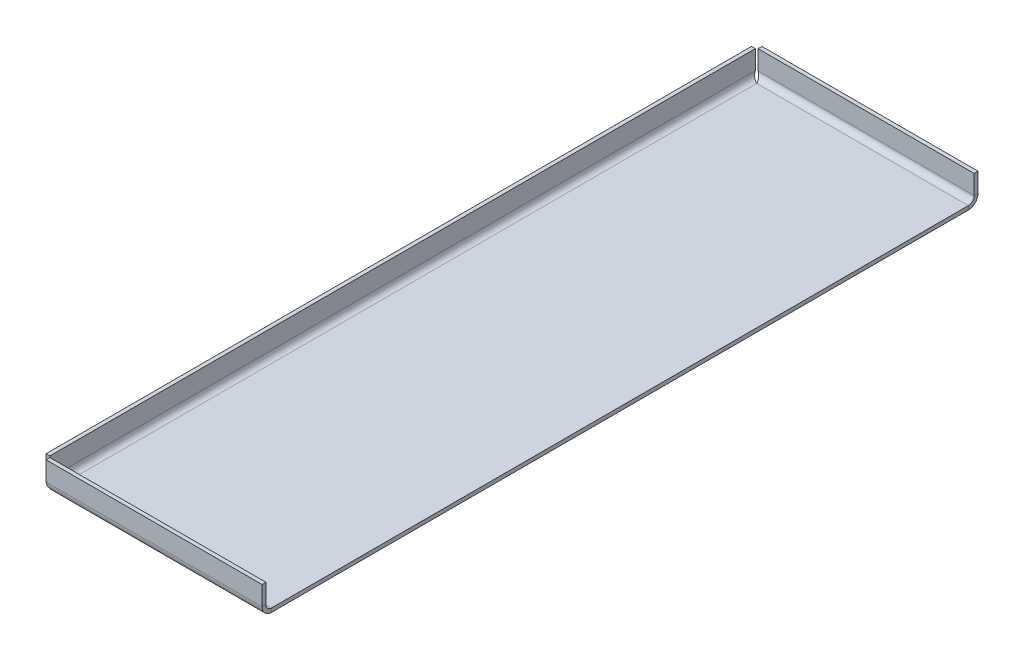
ISO-10303-21;
HEADER;
FILE_DESCRIPTION(('STEP AP214'),'2;1');
FILE_NAME('part.step','',(''),(''),'','','');
FILE_SCHEMA(('AUTOMOTIVE_DESIGN { 1 0 10303 214 1 1 1 1 }'));
ENDSEC;
DATA;
#1=APPLICATION_CONTEXT('core data for automotive mechanical design processes');
#2=APPLICATION_PROTOCOL_DEFINITION('international standard','automotive_design',2000,#1);
#3=PRODUCT_CONTEXT('',#1,'mechanical');
#4=PRODUCT('Part','Part','',(#3));
#5=PRODUCT_RELATED_PRODUCT_CATEGORY('part','',(#4));
#6=PRODUCT_DEFINITION_FORMATION('','',#4);
#7=PRODUCT_DEFINITION_CONTEXT('part definition',#1,'design');
#8=PRODUCT_DEFINITION('design','',#6,#7);
#9=PRODUCT_DEFINITION_SHAPE('','',#8);
#10=(LENGTH_UNIT() NAMED_UNIT(*) SI_UNIT(.MILLI.,.METRE.));
#11=(NAMED_UNIT(*) PLANE_ANGLE_UNIT() SI_UNIT($,.RADIAN.));
#12=(NAMED_UNIT(*) SI_UNIT($,.STERADIAN.) SOLID_ANGLE_UNIT());
#13=UNCERTAINTY_MEASURE_WITH_UNIT(LENGTH_MEASURE(1.E-05),#10,'distance_accuracy_value','');
#14=(GEOMETRIC_REPRESENTATION_CONTEXT(3) GLOBAL_UNCERTAINTY_ASSIGNED_CONTEXT((#13)) GLOBAL_UNIT_ASSIGNED_CONTEXT((#10,
#11,#12)) REPRESENTATION_CONTEXT('',''));
#15=CARTESIAN_POINT('',(0.,0.,0.));
#16=DIRECTION('',(0.,0.,1.));
#17=DIRECTION('',(1.,0.,0.));
#18=AXIS2_PLACEMENT_3D('',#15,#16,#17);
#19=CARTESIAN_POINT('',(-55.,-2.,181.));
#20=DIRECTION('',(0.,1.,0.));
#21=DIRECTION('',(-1.,0.,0.));
#22=AXIS2_PLACEMENT_3D('',#19,#20,#21);
#23=PLANE('',#22);
#24=DIRECTION('',(1.,0.,0.));
#25=VECTOR('',#24,1.);
#26=CARTESIAN_POINT('',(-55.,-2.,-181.));
#27=LINE('',#26,#25);
#28=CARTESIAN_POINT('',(-55.,-1.99999999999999,-181.));
#29=VERTEX_POINT('',#28);
#30=CARTESIAN_POINT('',(55.,-1.99999999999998,-181.));
#31=VERTEX_POINT('',#30);
#32=EDGE_CURVE('E300',#29,#31,#27,.T.);
#33=ORIENTED_EDGE('',*,*,#32,.T.);
#34=DIRECTION('',(0.,0.,-1.));
#35=VECTOR('',#34,1.);
#36=CARTESIAN_POINT('',(55.,-1.99999999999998,181.));
#37=LINE('',#36,#35);
#38=CARTESIAN_POINT('',(55.,-2.,181.));
#39=VERTEX_POINT('',#38);
#40=EDGE_CURVE('E13',#39,#31,#37,.T.);
#41=ORIENTED_EDGE('',*,*,#40,.F.);
#42=DIRECTION('',(1.,0.,0.));
#43=VECTOR('',#42,1.);
#44=CARTESIAN_POINT('',(-55.,-2.,181.));
#45=LINE('',#44,#43);
#46=CARTESIAN_POINT('',(-55.,-2.00000000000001,181.));
#47=VERTEX_POINT('',#46);
#48=EDGE_CURVE('E323',#47,#39,#45,.T.);
#49=ORIENTED_EDGE('',*,*,#48,.F.);
#50=DIRECTION('',(0.,0.,-1.));
#51=VECTOR('',#50,1.);
#52=CARTESIAN_POINT('',(-55.,-2.,181.));
#53=LINE('',#52,#51);
#54=EDGE_CURVE('E303',#47,#29,#53,.T.);
#55=ORIENTED_EDGE('',*,*,#54,.T.);
#56=EDGE_LOOP('',(#33,#41,#49,#55));
#57=FACE_BOUND('',#56,.T.);
#58=ADVANCED_FACE('F95',(#57),#23,.F.);
#59=CARTESIAN_POINT('',(55.,0.,181.));
#60=DIRECTION('',(1.,0.,0.));
#61=DIRECTION('',(0.,0.,-1.));
#62=AXIS2_PLACEMENT_3D('',#59,#60,#61);
#63=PLANE('',#62);
#64=DIRECTION('',(0.,-1.,0.));
#65=VECTOR('',#64,1.);
#66=CARTESIAN_POINT('',(55.,0.,-181.));
#67=LINE('',#66,#65);
#68=CARTESIAN_POINT('',(55.,0.,-181.));
#69=VERTEX_POINT('',#68);
#70=EDGE_CURVE('E306',#69,#31,#67,.T.);
#71=ORIENTED_EDGE('',*,*,#70,.F.);
#72=DIRECTION('',(0.,0.,-1.));
#73=VECTOR('',#72,1.);
#74=CARTESIAN_POINT('',(55.,0.,181.));
#75=LINE('',#74,#73);
#76=CARTESIAN_POINT('',(55.,0.,181.));
#77=VERTEX_POINT('',#76);
#78=EDGE_CURVE('E103',#77,#69,#75,.T.);
#79=ORIENTED_EDGE('',*,*,#78,.F.);
#80=DIRECTION('',(0.,-1.,0.));
#81=VECTOR('',#80,1.);
#82=CARTESIAN_POINT('',(55.,0.,181.));
#83=LINE('',#82,#81);
#84=EDGE_CURVE('E685',#77,#39,#83,.T.);
#85=ORIENTED_EDGE('',*,*,#84,.T.);
#86=ORIENTED_EDGE('',*,*,#40,.T.);
#87=EDGE_LOOP('',(#71,#79,#85,#86));
#88=FACE_BOUND('',#87,.T.);
#89=ADVANCED_FACE('F290',(#88),#63,.T.);
#90=CARTESIAN_POINT('',(-55.,0.,181.));
#91=DIRECTION('',(0.,1.,0.));
#92=DIRECTION('',(-1.,0.,0.));
#93=AXIS2_PLACEMENT_3D('',#90,#91,#92);
#94=PLANE('',#93);
#95=DIRECTION('',(1.,0.,0.));
#96=VECTOR('',#95,1.);
#97=CARTESIAN_POINT('',(-55.,0.,-181.));
#98=LINE('',#97,#96);
#99=CARTESIAN_POINT('',(-55.,0.,-181.));
#100=VERTEX_POINT('',#99);
#101=EDGE_CURVE('E310',#100,#69,#98,.T.);
#102=ORIENTED_EDGE('',*,*,#101,.F.);
#103=DIRECTION('',(0.,0.,-1.));
#104=VECTOR('',#103,1.);
#105=CARTESIAN_POINT('',(-55.,0.,181.));
#106=LINE('',#105,#104);
#107=CARTESIAN_POINT('',(-55.,0.,181.));
#108=VERTEX_POINT('',#107);
#109=EDGE_CURVE('E325',#108,#100,#106,.T.);
#110=ORIENTED_EDGE('',*,*,#109,.F.);
#111=DIRECTION('',(1.,0.,0.));
#112=VECTOR('',#111,1.);
#113=CARTESIAN_POINT('',(-55.,0.,181.));
#114=LINE('',#113,#112);
#115=EDGE_CURVE('E329',#108,#77,#114,.T.);
#116=ORIENTED_EDGE('',*,*,#115,.T.);
#117=ORIENTED_EDGE('',*,*,#78,.T.);
#118=EDGE_LOOP('',(#102,#110,#116,#117));
#119=FACE_BOUND('',#118,.T.);
#120=ADVANCED_FACE('F295',(#119),#94,.T.);
#121=CARTESIAN_POINT('',(55.,3.00000000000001,-181.));
#122=DIRECTION('',(1.,0.,0.));
#123=DIRECTION('',(0.,0.,-1.));
#124=AXIS2_PLACEMENT_3D('',#121,#122,#123);
#125=PLANE('',#124);
#126=DIRECTION('',(0.,0.,1.));
#127=VECTOR('',#126,1.);
#128=CARTESIAN_POINT('',(55.,3.00000000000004,-186.));
#129=LINE('',#128,#127);
#130=CARTESIAN_POINT('',(55.,3.,-184.));
#131=VERTEX_POINT('',#130);
#132=CARTESIAN_POINT('',(55.,2.99999999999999,-186.));
#133=VERTEX_POINT('',#132);
#134=EDGE_CURVE('E337',#131,#133,#129,.F.);
#135=ORIENTED_EDGE('',*,*,#134,.F.);
#136=CARTESIAN_POINT('',(55.,3.00000000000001,-181.));
#137=DIRECTION('',(-1.,0.,0.));
#138=DIRECTION('',(0.,0.,1.));
#139=AXIS2_PLACEMENT_3D('',#136,#137,#138);
#140=CIRCLE('',#139,3.);
#141=EDGE_CURVE('E336',#69,#131,#140,.F.);
#142=ORIENTED_EDGE('',*,*,#141,.F.);
#143=ORIENTED_EDGE('',*,*,#70,.T.);
#144=CARTESIAN_POINT('',(55.,3.00000000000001,-181.));
#145=DIRECTION('',(-1.,0.,0.));
#146=DIRECTION('',(0.,0.,1.));
#147=AXIS2_PLACEMENT_3D('',#144,#145,#146);
#148=CIRCLE('',#147,5.);
#149=EDGE_CURVE('E307',#31,#133,#148,.F.);
#150=ORIENTED_EDGE('',*,*,#149,.T.);
#151=EDGE_LOOP('',(#135,#142,#143,#150));
#152=FACE_BOUND('',#151,.T.);
#153=ADVANCED_FACE('F333',(#152),#125,.T.);
#154=CARTESIAN_POINT('',(-57.2928932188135,3.00000000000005,-186.02));
#155=CARTESIAN_POINT('',(-57.1017870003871,2.34277428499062,-186.02));
#156=CARTESIAN_POINT('',(-56.9107443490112,1.68602562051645,-185.889342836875));
#157=CARTESIAN_POINT('',(-56.528595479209,0.471832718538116,-185.386407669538));
#158=CARTESIAN_POINT('',(-56.3375210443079,-0.0850245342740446,-185.014327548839));
#159=CARTESIAN_POINT('',(-55.9553721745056,-1.01432754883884,-184.085024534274));
#160=CARTESIAN_POINT('',(-55.7642977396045,-1.38640766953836,-183.528167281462));
#161=CARTESIAN_POINT('',(-55.3821488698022,-1.88934283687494,-182.313974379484));
#162=CARTESIAN_POINT('',(-55.1911062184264,-2.01999999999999,-181.65722571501));
#163=CARTESIAN_POINT('',(-55.,-2.01999999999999,-181.));
#164=CARTESIAN_POINT('',(-57.2928932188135,3.00000000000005,-186.));
#165=CARTESIAN_POINT('',(-57.1017870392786,2.34539279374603,-186.));
#166=CARTESIAN_POINT('',(-56.9107443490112,1.69126057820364,-185.869863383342));
#167=CARTESIAN_POINT('',(-56.528595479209,0.481905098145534,-185.368931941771));
#168=CARTESIAN_POINT('',(-56.3375210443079,-0.0727335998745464,-184.998334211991));
#169=CARTESIAN_POINT('',(-55.9553721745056,-0.998334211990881,-184.072733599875));
#170=CARTESIAN_POINT('',(-55.7642977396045,-1.36893194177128,-183.518094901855));
#171=CARTESIAN_POINT('',(-55.3821488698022,-1.86986338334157,-182.308739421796));
#172=CARTESIAN_POINT('',(-55.1911061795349,-1.99999999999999,-181.654607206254));
#173=CARTESIAN_POINT('',(-55.,-1.99999999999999,-181.));
#174=CARTESIAN_POINT('',(-57.2928932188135,3.00000000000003,-184.));
#175=CARTESIAN_POINT('',(-57.1017909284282,2.60724366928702,-184.));
#176=CARTESIAN_POINT('',(-56.9107443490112,2.21475634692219,-183.921918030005));
#177=CARTESIAN_POINT('',(-56.528595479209,1.48914305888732,-183.621359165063));
#178=CARTESIAN_POINT('',(-56.3375210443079,1.15635984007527,-183.399000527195));
#179=CARTESIAN_POINT('',(-55.9553721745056,0.600999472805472,-182.843640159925));
#180=CARTESIAN_POINT('',(-55.7642977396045,0.378640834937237,-182.510856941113));
#181=CARTESIAN_POINT('',(-55.3821488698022,0.0780819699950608,-181.785243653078));
#182=CARTESIAN_POINT('',(-55.1911022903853,0.,-181.392756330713));
#183=CARTESIAN_POINT('',(-55.,0.,-181.));
#184=CARTESIAN_POINT('',(-57.2928932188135,3.00000000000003,-183.9798));
#185=CARTESIAN_POINT('',(-57.1017909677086,2.60988836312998,-183.9798));
#186=CARTESIAN_POINT('',(-56.9107443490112,2.22004365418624,-183.902243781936));
#187=CARTESIAN_POINT('',(-56.528595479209,1.49931616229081,-183.603708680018));
#188=CARTESIAN_POINT('',(-56.3375210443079,1.16877368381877,-183.382847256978));
#189=CARTESIAN_POINT('',(-55.9553721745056,0.617152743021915,-182.831226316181));
#190=CARTESIAN_POINT('',(-55.7642977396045,0.396291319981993,-182.500683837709));
#191=CARTESIAN_POINT('',(-55.3821488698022,0.0977562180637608,-181.779956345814));
#192=CARTESIAN_POINT('',(-55.1911022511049,0.0202000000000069,-181.39011163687));
#193=CARTESIAN_POINT('',(-55.,0.0202000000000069,-181.));
#194=B_SPLINE_SURFACE_WITH_KNOTS('',1,3,((#154,#155,#156,#157,#158,#159,#160,#161,#162,#163),
(#164,#165,#166,#167,#168,#169,#170,#171,#172,#173),(#174,#175,#176,#177,#178,#179,#180,#181,
#182,#183),(#184,#185,#186,#187,#188,#189,#190,#191,#192,#193)),.UNSPECIFIED.,.F.,.F.,.F.,(2,1,
1,2),(4,2,2,2,4),(-0.01,0.,1.,1.0101),(0.,0.25,0.5,0.75,1.),.UNSPECIFIED.);
#195=CARTESIAN_POINT('',(-57.2928932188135,3.00000000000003,-184.));
#196=CARTESIAN_POINT('',(-57.2552663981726,2.92267324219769,-183.999998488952));
#197=CARTESIAN_POINT('',(-57.2176563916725,2.84537873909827,-183.997008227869));
#198=CARTESIAN_POINT('',(-57.1424432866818,2.69126243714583,-183.985073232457));
#199=CARTESIAN_POINT('',(-57.1048401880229,2.61444056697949,-183.976129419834));
#200=CARTESIAN_POINT('',(-56.9919821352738,2.38525678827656,-183.940400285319));
#201=CARTESIAN_POINT('',(-56.9166800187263,2.23418002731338,-183.904717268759));
#202=CARTESIAN_POINT('',(-56.7957539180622,1.99743986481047,-183.829084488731));
#203=CARTESIAN_POINT('',(-56.7500950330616,1.90939953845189,-183.796320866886));
#204=CARTESIAN_POINT('',(-56.658779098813,1.73677909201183,-183.722693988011));
#205=CARTESIAN_POINT('',(-56.6131220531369,1.65219794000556,-183.681833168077));
#206=CARTESIAN_POINT('',(-56.5217962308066,1.48720795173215,-183.592349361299));
#207=CARTESIAN_POINT('',(-56.4761274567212,1.40680079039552,-183.543723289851));
#208=CARTESIAN_POINT('',(-56.3848064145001,1.25092626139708,-183.439168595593));
#209=CARTESIAN_POINT('',(-56.3391541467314,1.17545701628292,-183.38324277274));
#210=CARTESIAN_POINT('',(-56.247827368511,1.03006114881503,-183.264542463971));
#211=CARTESIAN_POINT('',(-56.202152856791,0.960136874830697,-183.201765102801));
#212=CARTESIAN_POINT('',(-56.1108207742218,0.826504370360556,-183.069956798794));
#213=CARTESIAN_POINT('',(-56.0651632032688,0.76279388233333,-183.000928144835));
#214=CARTESIAN_POINT('',(-55.9738172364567,0.642076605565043,-182.857152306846));
#215=CARTESIAN_POINT('',(-55.9281288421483,0.585074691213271,-182.782401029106));
#216=CARTESIAN_POINT('',(-55.836770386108,0.47835042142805,-182.627911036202));
#217=CARTESIAN_POINT('',(-55.791100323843,0.428625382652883,-182.548174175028));
#218=CARTESIAN_POINT('',(-55.6997154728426,0.336827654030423,-182.384319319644));
#219=CARTESIAN_POINT('',(-55.6540006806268,0.294761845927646,-182.30019747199));
#220=CARTESIAN_POINT('',(-55.5625885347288,0.218721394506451,-182.128409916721));
#221=CARTESIAN_POINT('',(-55.5168911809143,0.184743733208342,-182.040745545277));
#222=CARTESIAN_POINT('',(-55.4255435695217,0.125188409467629,-181.862706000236));
#223=CARTESIAN_POINT('',(-55.3798933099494,0.0996024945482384,-181.772333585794));
#224=CARTESIAN_POINT('',(-55.2886128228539,0.0570188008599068,-181.589622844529));
#225=CARTESIAN_POINT('',(-55.2429825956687,0.040017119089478,-181.497285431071));
#226=CARTESIAN_POINT('',(-55.1644349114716,0.0182567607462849,-181.337323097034));
#227=CARTESIAN_POINT('',(-55.1315153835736,0.0114072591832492,-181.269976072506));
#228=CARTESIAN_POINT('',(-55.0657315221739,0.00228142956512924,-181.135087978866));
#229=CARTESIAN_POINT('',(-55.0328671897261,-2.63273380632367E-06,-181.067547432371));
#230=CARTESIAN_POINT('',(-55.,0.,-181.));
#231=B_SPLINE_CURVE_WITH_KNOTS('',3,(#195,#196,#197,#198,#199,#200,#201,#202,#203,#204,#205,
#206,#207,#208,#209,#210,#211,#212,#213,#214,#215,#216,#217,#218,#219,#220,#221,#222,#223,#224,
#225,#226,#227,#228,#229,#230),.UNSPECIFIED.,.F.,.F.,(4,2,2,2,2,2,2,2,2,2,2,2,2,2,2,2,2,4),(0.,
0.257861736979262,0.515683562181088,1.03133815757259,1.34437075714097,1.65730928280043,
1.97037242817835,2.28331584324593,2.59639109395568,2.90935217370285,3.22253926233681,
3.53561057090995,3.84896179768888,4.16219591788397,4.47512107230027,4.78790382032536,
5.01359498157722,5.23890347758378),.UNSPECIFIED.);
#232=CARTESIAN_POINT('',(-57.2928932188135,3.,-184.));
#233=VERTEX_POINT('',#232);
#234=EDGE_CURVE('E340',#233,#100,#231,.T.);
#235=DIRECTION('',(0.,0.,1.));
#236=VECTOR('',#235,1.);
#237=CARTESIAN_POINT('',(-57.2928932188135,3.00000000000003,-184.));
#238=LINE('',#237,#236);
#239=CARTESIAN_POINT('',(-57.2928932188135,3.00000000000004,-186.));
#240=VERTEX_POINT('',#239);
#241=EDGE_CURVE('E734',#233,#240,#238,.F.);
#242=CARTESIAN_POINT('',(-57.2928932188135,3.00000000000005,-186.));
#243=CARTESIAN_POINT('',(-57.2501181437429,2.85348621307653,-186.000017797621));
#244=CARTESIAN_POINT('',(-57.2073439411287,2.70697482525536,-185.99356086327));
#245=CARTESIAN_POINT('',(-57.1217996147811,2.41508918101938,-185.967826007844));
#246=CARTESIAN_POINT('',(-57.0790294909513,2.26971486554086,-185.948548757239));
#247=CARTESIAN_POINT('',(-56.9935246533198,1.98133302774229,-185.897321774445));
#248=CARTESIAN_POINT('',(-56.9507899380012,1.83832374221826,-185.865381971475));
#249=CARTESIAN_POINT('',(-56.8653171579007,1.55566100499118,-185.789082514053));
#250=CARTESIAN_POINT('',(-56.8225790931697,1.41600750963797,-185.744723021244));
#251=CARTESIAN_POINT('',(-56.7370801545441,1.14105532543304,-185.643896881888));
#252=CARTESIAN_POINT('',(-56.694319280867,1.00575904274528,-185.587423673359));
#253=CARTESIAN_POINT('',(-56.6087814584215,0.74059630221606,-185.462797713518));
#254=CARTESIAN_POINT('',(-56.5660045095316,0.610731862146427,-185.394640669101));
#255=CARTESIAN_POINT('',(-56.4804798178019,0.357562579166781,-185.247230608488));
#256=CARTESIAN_POINT('',(-56.4377320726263,0.234253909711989,-185.16798416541));
#257=CARTESIAN_POINT('',(-56.3522195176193,-0.0049751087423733,-184.998947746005));
#258=CARTESIAN_POINT('',(-56.3094547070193,-0.120892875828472,-184.909154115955));
#259=CARTESIAN_POINT('',(-56.2239329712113,-0.344373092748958,-184.719760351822));
#260=CARTESIAN_POINT('',(-56.1811760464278,-0.451937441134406,-184.620162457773));
#261=CARTESIAN_POINT('',(-56.0956618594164,-0.6579105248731,-184.411911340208));
#262=CARTESIAN_POINT('',(-56.0529045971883,-0.756319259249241,-184.303258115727));
#263=CARTESIAN_POINT('',(-55.9673708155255,-0.943270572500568,-184.077675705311));
#264=CARTESIAN_POINT('',(-55.9245942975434,-1.0318080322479,-183.960742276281));
#265=CARTESIAN_POINT('',(-55.839057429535,-1.19824493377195,-183.719594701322));
#266=CARTESIAN_POINT('',(-55.7962970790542,-1.27614806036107,-183.595383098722));
#267=CARTESIAN_POINT('',(-55.7107411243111,-1.42080344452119,-183.340509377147));
#268=CARTESIAN_POINT('',(-55.6679455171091,-1.48754751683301,-183.209842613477));
#269=CARTESIAN_POINT('',(-55.5823707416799,-1.60927791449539,-182.943200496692));
#270=CARTESIAN_POINT('',(-55.5395915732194,-1.66426857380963,-182.807227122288));
#271=CARTESIAN_POINT('',(-55.454064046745,-1.76206307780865,-182.531076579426));
#272=CARTESIAN_POINT('',(-55.4113156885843,-1.80487561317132,-182.39090248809));
#273=CARTESIAN_POINT('',(-55.3258379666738,-1.8780239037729,-182.107388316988));
#274=CARTESIAN_POINT('',(-55.283108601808,-1.90836432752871,-181.964049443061));
#275=CARTESIAN_POINT('',(-55.2002816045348,-1.95487405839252,-181.684164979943));
#276=CARTESIAN_POINT('',(-55.1601839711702,-1.97180107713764,-181.547744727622));
#277=CARTESIAN_POINT('',(-55.0800580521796,-1.99436061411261,-181.274216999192));
#278=CARTESIAN_POINT('',(-55.0400297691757,-2.0000130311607,-181.137111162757));
#279=CARTESIAN_POINT('',(-55.,-1.99999999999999,-181.));
#280=B_SPLINE_CURVE_WITH_KNOTS('',3,(#242,#243,#244,#245,#246,#247,#248,#249,#250,#251,#252,
#253,#254,#255,#256,#257,#258,#259,#260,#261,#262,#263,#264,#265,#266,#267,#268,#269,#270,#271,
#272,#273,#274,#275,#276,#277,#278,#279),.UNSPECIFIED.,.F.,.F.,(4,2,2,2,2,2,2,2,2,2,2,2,2,2,2,2,
2,2,4),(0.,0.457750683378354,0.915477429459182,1.37284596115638,1.83020854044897,
2.2878195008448,2.74559896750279,3.20310823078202,3.6607764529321,4.11834035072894,
4.57590429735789,5.03370443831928,5.49134554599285,5.94932087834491,6.40712704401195,
6.86460568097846,7.32191291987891,7.75105444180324,8.17943788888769),.UNSPECIFIED.);
#281=EDGE_CURVE('E313',#240,#29,#280,.T.);
#282=DIRECTION('',(0.,1.,0.));
#283=VECTOR('',#282,1.);
#284=CARTESIAN_POINT('',(-55.,-2.,-181.));
#285=LINE('',#284,#283);
#286=EDGE_CURVE('E320',#29,#100,#285,.T.);
#287=ORIENTED_EDGE('',*,*,#234,.F.);
#288=ORIENTED_EDGE('',*,*,#241,.T.);
#289=ORIENTED_EDGE('',*,*,#281,.T.);
#290=ORIENTED_EDGE('',*,*,#286,.T.);
#291=EDGE_LOOP('',(#287,#288,#289,#290));
#292=FACE_BOUND('',#291,.T.);
#293=ADVANCED_FACE('F357',(#292),#194,.F.);
#294=CARTESIAN_POINT('',(-57.2928932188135,3.00000000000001,-181.));
#295=DIRECTION('',(-1.,0.,0.));
#296=DIRECTION('',(0.,0.,-1.));
#297=AXIS2_PLACEMENT_3D('',#294,#295,#296);
#298=CYLINDRICAL_SURFACE('',#297,5.);
#299=ORIENTED_EDGE('',*,*,#32,.F.);
#300=ORIENTED_EDGE('',*,*,#281,.F.);
#301=DIRECTION('',(-1.,0.,0.));
#302=VECTOR('',#301,1.);
#303=CARTESIAN_POINT('',(55.,3.00000000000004,-186.));
#304=LINE('',#303,#302);
#305=EDGE_CURVE('E778',#240,#133,#304,.F.);
#306=ORIENTED_EDGE('',*,*,#305,.T.);
#307=ORIENTED_EDGE('',*,*,#149,.F.);
#308=EDGE_LOOP('',(#299,#300,#306,#307));
#309=FACE_BOUND('',#308,.T.);
#310=ADVANCED_FACE('F363',(#309),#298,.T.);
#311=CARTESIAN_POINT('',(-57.2928932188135,3.00000000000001,-181.));
#312=DIRECTION('',(-1.,0.,0.));
#313=DIRECTION('',(0.,0.,-1.));
#314=AXIS2_PLACEMENT_3D('',#311,#312,#313);
#315=CYLINDRICAL_SURFACE('',#314,3.);
#316=ORIENTED_EDGE('',*,*,#101,.T.);
#317=ORIENTED_EDGE('',*,*,#141,.T.);
#318=DIRECTION('',(-1.,0.,0.));
#319=VECTOR('',#318,1.);
#320=CARTESIAN_POINT('',(55.,3.00000000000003,-184.));
#321=LINE('',#320,#319);
#322=EDGE_CURVE('E774',#131,#233,#321,.T.);
#323=ORIENTED_EDGE('',*,*,#322,.T.);
#324=ORIENTED_EDGE('',*,*,#234,.T.);
#325=EDGE_LOOP('',(#316,#317,#323,#324));
#326=FACE_BOUND('',#325,.T.);
#327=ADVANCED_FACE('F367',(#326),#315,.F.);
#328=CARTESIAN_POINT('',(55.,0.,-186.));
#329=DIRECTION('',(-1.,0.,0.));
#330=DIRECTION('',(0.,0.,1.));
#331=AXIS2_PLACEMENT_3D('',#328,#329,#330);
#332=PLANE('',#331);
#333=ORIENTED_EDGE('',*,*,#134,.T.);
#334=DIRECTION('',(0.,-1.,0.));
#335=VECTOR('',#334,1.);
#336=CARTESIAN_POINT('',(55.,0.,-186.));
#337=LINE('',#336,#335);
#338=CARTESIAN_POINT('',(55.,13.,-186.));
#339=VERTEX_POINT('',#338);
#340=EDGE_CURVE('E797',#339,#133,#337,.T.);
#341=ORIENTED_EDGE('',*,*,#340,.F.);
#342=DIRECTION('',(0.,0.,1.));
#343=VECTOR('',#342,1.);
#344=CARTESIAN_POINT('',(55.,13.,-186.));
#345=LINE('',#344,#343);
#346=CARTESIAN_POINT('',(55.,13.,-184.));
#347=VERTEX_POINT('',#346);
#348=EDGE_CURVE('E344',#339,#347,#345,.T.);
#349=ORIENTED_EDGE('',*,*,#348,.T.);
#350=DIRECTION('',(0.,1.,0.));
#351=VECTOR('',#350,1.);
#352=CARTESIAN_POINT('',(55.,0.,-184.));
#353=LINE('',#352,#351);
#354=EDGE_CURVE('E802',#347,#131,#353,.F.);
#355=ORIENTED_EDGE('',*,*,#354,.T.);
#356=EDGE_LOOP('',(#333,#341,#349,#355));
#357=FACE_BOUND('',#356,.T.);
#358=ADVANCED_FACE('F372',(#357),#332,.F.);
#359=CARTESIAN_POINT('',(-55.,0.,-186.));
#360=DIRECTION('',(0.,0.,1.));
#361=DIRECTION('',(0.,-1.,0.));
#362=AXIS2_PLACEMENT_3D('',#359,#360,#361);
#363=PLANE('',#362);
#364=ORIENTED_EDGE('',*,*,#305,.F.);
#365=DIRECTION('',(0.,1.,0.));
#366=VECTOR('',#365,1.);
#367=CARTESIAN_POINT('',(-57.2928932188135,0.,-186.));
#368=LINE('',#367,#366);
#369=CARTESIAN_POINT('',(-57.2928932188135,13.,-186.));
#370=VERTEX_POINT('',#369);
#371=EDGE_CURVE('E782',#240,#370,#368,.T.);
#372=ORIENTED_EDGE('',*,*,#371,.T.);
#373=DIRECTION('',(1.,0.,0.));
#374=VECTOR('',#373,1.);
#375=CARTESIAN_POINT('',(-55.,13.,-186.));
#376=LINE('',#375,#374);
#377=EDGE_CURVE('E801',#370,#339,#376,.T.);
#378=ORIENTED_EDGE('',*,*,#377,.T.);
#379=ORIENTED_EDGE('',*,*,#340,.T.);
#380=EDGE_LOOP('',(#364,#372,#378,#379));
#381=FACE_BOUND('',#380,.T.);
#382=ADVANCED_FACE('F429',(#381),#363,.F.);
#383=CARTESIAN_POINT('',(-55.,0.,-184.));
#384=DIRECTION('',(0.,0.,1.));
#385=DIRECTION('',(0.,-1.,0.));
#386=AXIS2_PLACEMENT_3D('',#383,#384,#385);
#387=PLANE('',#386);
#388=DIRECTION('',(-1.,0.,0.));
#389=VECTOR('',#388,1.);
#390=CARTESIAN_POINT('',(55.,13.,-184.));
#391=LINE('',#390,#389);
#392=CARTESIAN_POINT('',(-57.2928932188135,13.,-184.));
#393=VERTEX_POINT('',#392);
#394=EDGE_CURVE('E780',#393,#347,#391,.F.);
#395=ORIENTED_EDGE('',*,*,#394,.F.);
#396=DIRECTION('',(0.,-1.,0.));
#397=VECTOR('',#396,1.);
#398=CARTESIAN_POINT('',(-57.2928932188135,13.,-184.));
#399=LINE('',#398,#397);
#400=EDGE_CURVE('E791',#233,#393,#399,.F.);
#401=ORIENTED_EDGE('',*,*,#400,.F.);
#402=ORIENTED_EDGE('',*,*,#322,.F.);
#403=ORIENTED_EDGE('',*,*,#354,.F.);
#404=EDGE_LOOP('',(#395,#401,#402,#403));
#405=FACE_BOUND('',#404,.T.);
#406=ADVANCED_FACE('F438',(#405),#387,.T.);
#407=CARTESIAN_POINT('',(55.,13.,-186.));
#408=DIRECTION('',(0.,-1.,0.));
#409=DIRECTION('',(0.,0.,-1.));
#410=AXIS2_PLACEMENT_3D('',#407,#408,#409);
#411=PLANE('',#410);
#412=ORIENTED_EDGE('',*,*,#394,.T.);
#413=ORIENTED_EDGE('',*,*,#348,.F.);
#414=ORIENTED_EDGE('',*,*,#377,.F.);
#415=DIRECTION('',(0.,0.,1.));
#416=VECTOR('',#415,1.);
#417=CARTESIAN_POINT('',(-57.2928932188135,13.,-186.));
#418=LINE('',#417,#416);
#419=EDGE_CURVE('E788',#370,#393,#418,.T.);
#420=ORIENTED_EDGE('',*,*,#419,.T.);
#421=EDGE_LOOP('',(#412,#413,#414,#420));
#422=FACE_BOUND('',#421,.T.);
#423=ADVANCED_FACE('F368',(#422),#411,.F.);
#424=CARTESIAN_POINT('',(-57.2928932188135,13.,-186.));
#425=DIRECTION('',(1.,0.,0.));
#426=DIRECTION('',(0.,0.,-1.));
#427=AXIS2_PLACEMENT_3D('',#424,#425,#426);
#428=PLANE('',#427);
#429=ORIENTED_EDGE('',*,*,#241,.F.);
#430=ORIENTED_EDGE('',*,*,#400,.T.);
#431=ORIENTED_EDGE('',*,*,#419,.F.);
#432=ORIENTED_EDGE('',*,*,#371,.F.);
#433=EDGE_LOOP('',(#429,#430,#431,#432));
#434=FACE_BOUND('',#433,.T.);
#435=ADVANCED_FACE('F457',(#434),#428,.F.);
#436=CARTESIAN_POINT('',(-55.,-2.02000000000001,-181.));
#437=CARTESIAN_POINT('',(-55.6572257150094,-2.02000000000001,-181.191106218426));
#438=CARTESIAN_POINT('',(-56.3139743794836,-1.88934283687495,-181.382148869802));
#439=CARTESIAN_POINT('',(-57.5281672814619,-1.38640766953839,-181.764297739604));
#440=CARTESIAN_POINT('',(-58.0850245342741,-1.01432754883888,-181.955372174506));
#441=CARTESIAN_POINT('',(-59.0143275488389,-0.0850245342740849,-182.337521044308));
#442=CARTESIAN_POINT('',(-59.3864076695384,0.471832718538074,-182.528595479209));
#443=CARTESIAN_POINT('',(-59.889342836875,1.6860256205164,-182.910744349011));
#444=CARTESIAN_POINT('',(-60.02,2.34277428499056,-183.101787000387));
#445=CARTESIAN_POINT('',(-60.02,2.99999999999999,-183.292893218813));
#446=CARTESIAN_POINT('',(-55.,-2.00000000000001,-181.));
#447=CARTESIAN_POINT('',(-55.654607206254,-2.00000000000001,-181.191106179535));
#448=CARTESIAN_POINT('',(-56.3087394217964,-1.86986338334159,-181.382148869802));
#449=CARTESIAN_POINT('',(-57.5180949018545,-1.3689319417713,-181.764297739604));
#450=CARTESIAN_POINT('',(-58.0727335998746,-0.998334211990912,-181.955372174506));
#451=CARTESIAN_POINT('',(-58.9983342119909,-0.0727335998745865,-182.337521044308));
#452=CARTESIAN_POINT('',(-59.3689319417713,0.481905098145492,-182.528595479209));
#453=CARTESIAN_POINT('',(-59.8698633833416,1.69126057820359,-182.910744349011));
#454=CARTESIAN_POINT('',(-60.,2.34539279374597,-183.101787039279));
#455=CARTESIAN_POINT('',(-60.,2.99999999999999,-183.292893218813));
#456=CARTESIAN_POINT('',(-55.,0.,-181.));
#457=CARTESIAN_POINT('',(-55.392756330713,0.,-181.191102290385));
#458=CARTESIAN_POINT('',(-55.7852436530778,0.0780819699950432,-181.382148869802));
#459=CARTESIAN_POINT('',(-56.5108569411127,0.378640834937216,-181.764297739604));
#460=CARTESIAN_POINT('',(-56.8436401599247,0.60099947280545,-181.955372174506));
#461=CARTESIAN_POINT('',(-57.3990005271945,1.15635984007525,-182.337521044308));
#462=CARTESIAN_POINT('',(-57.6213591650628,1.48914305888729,-182.528595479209));
#463=CARTESIAN_POINT('',(-57.921918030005,2.21475634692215,-182.910744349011));
#464=CARTESIAN_POINT('',(-58.,2.60724366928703,-183.101790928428));
#465=CARTESIAN_POINT('',(-58.,2.99999999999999,-183.292893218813));
#466=CARTESIAN_POINT('',(-55.,0.02019999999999,-181.));
#467=CARTESIAN_POINT('',(-55.39011163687,0.0201999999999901,-181.191102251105));
#468=CARTESIAN_POINT('',(-55.7799563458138,0.0977562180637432,-181.382148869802));
#469=CARTESIAN_POINT('',(-56.5006838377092,0.396291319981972,-181.764297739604));
#470=CARTESIAN_POINT('',(-56.8312263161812,0.617152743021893,-181.955372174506));
#471=CARTESIAN_POINT('',(-57.3828472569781,1.16877368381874,-182.337521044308));
#472=CARTESIAN_POINT('',(-57.603708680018,1.49931616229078,-182.528595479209));
#473=CARTESIAN_POINT('',(-57.9022437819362,2.22004365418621,-182.910744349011));
#474=CARTESIAN_POINT('',(-57.9798,2.60988836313,-183.101790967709));
#475=CARTESIAN_POINT('',(-57.9798,2.99999999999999,-183.292893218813));
#476=B_SPLINE_SURFACE_WITH_KNOTS('',1,3,((#436,#437,#438,#439,#440,#441,#442,#443,#444,#445),
(#446,#447,#448,#449,#450,#451,#452,#453,#454,#455),(#456,#457,#458,#459,#460,#461,#462,#463,
#464,#465),(#466,#467,#468,#469,#470,#471,#472,#473,#474,#475)),.UNSPECIFIED.,.F.,.F.,.F.,(2,1,
1,2),(4,2,2,2,4),(-0.01,0.,1.,1.0101),(0.,0.25,0.5,0.75,1.),.UNSPECIFIED.);
#477=DIRECTION('',(1.,0.,0.));
#478=VECTOR('',#477,1.);
#479=CARTESIAN_POINT('',(-60.,2.99999999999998,-183.292893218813));
#480=LINE('',#479,#478);
#481=CARTESIAN_POINT('',(-58.,2.99999999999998,-183.292893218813));
#482=VERTEX_POINT('',#481);
#483=CARTESIAN_POINT('',(-60.,2.99999999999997,-183.292893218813));
#484=VERTEX_POINT('',#483);
#485=EDGE_CURVE('E261',#482,#484,#480,.F.);
#486=CARTESIAN_POINT('',(-55.,0.,-181.));
#487=CARTESIAN_POINT('',(-55.0773267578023,1.51104760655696E-06,-181.037626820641));
#488=CARTESIAN_POINT('',(-55.1546212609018,0.00299177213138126,-181.075236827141));
#489=CARTESIAN_POINT('',(-55.3087375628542,0.0149267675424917,-181.150449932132));
#490=CARTESIAN_POINT('',(-55.3855594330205,0.0238705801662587,-181.18805303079));
#491=CARTESIAN_POINT('',(-55.6147432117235,0.0595997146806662,-181.30091108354));
#492=CARTESIAN_POINT('',(-55.7658199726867,0.095282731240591,-181.376213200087));
#493=CARTESIAN_POINT('',(-56.0025601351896,0.170915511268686,-181.497139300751));
#494=CARTESIAN_POINT('',(-56.0906004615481,0.203679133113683,-181.542798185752));
#495=CARTESIAN_POINT('',(-56.2632209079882,0.277306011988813,-181.63411412));
#496=CARTESIAN_POINT('',(-56.3478020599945,0.318166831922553,-181.679771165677));
#497=CARTESIAN_POINT('',(-56.5127920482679,0.407650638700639,-181.771096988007));
#498=CARTESIAN_POINT('',(-56.5931992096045,0.456276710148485,-181.816765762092));
#499=CARTESIAN_POINT('',(-56.7490737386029,0.560831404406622,-181.908086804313));
#500=CARTESIAN_POINT('',(-56.8245429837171,0.616757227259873,-181.953739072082));
#501=CARTESIAN_POINT('',(-56.969938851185,0.735457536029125,-182.045065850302));
#502=CARTESIAN_POINT('',(-57.0398631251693,0.798234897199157,-182.090740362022));
#503=CARTESIAN_POINT('',(-57.1734956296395,0.930043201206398,-182.182072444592));
#504=CARTESIAN_POINT('',(-57.2372061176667,0.999071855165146,-182.227730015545));
#505=CARTESIAN_POINT('',(-57.357923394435,1.14284769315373,-182.319075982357));
#506=CARTESIAN_POINT('',(-57.4149253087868,1.21759897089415,-182.364764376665));
#507=CARTESIAN_POINT('',(-57.521649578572,1.37208896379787,-182.456122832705));
#508=CARTESIAN_POINT('',(-57.5713746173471,1.45182582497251,-182.50179289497));
#509=CARTESIAN_POINT('',(-57.6631723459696,1.61568068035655,-182.593177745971));
#510=CARTESIAN_POINT('',(-57.7052381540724,1.69980252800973,-182.638892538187));
#511=CARTESIAN_POINT('',(-57.7812786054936,1.8715900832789,-182.730304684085));
#512=CARTESIAN_POINT('',(-57.8152562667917,1.95925445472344,-182.776002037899));
#513=CARTESIAN_POINT('',(-57.8748115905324,2.13729399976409,-182.867349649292));
#514=CARTESIAN_POINT('',(-57.9003975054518,2.22766641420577,-182.912999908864));
#515=CARTESIAN_POINT('',(-57.9429811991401,2.41037715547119,-183.00428039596));
#516=CARTESIAN_POINT('',(-57.9599828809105,2.5027145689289,-183.049910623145));
#517=CARTESIAN_POINT('',(-57.9817432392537,2.66267690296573,-183.128458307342));
#518=CARTESIAN_POINT('',(-57.9885927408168,2.73002392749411,-183.16137783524));
#519=CARTESIAN_POINT('',(-57.9977185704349,2.8649120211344,-183.22716169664));
#520=CARTESIAN_POINT('',(-58.0000026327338,2.93245256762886,-183.260026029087));
#521=CARTESIAN_POINT('',(-58.,2.99999999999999,-183.292893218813));
#522=B_SPLINE_CURVE_WITH_KNOTS('',3,(#486,#487,#488,#489,#490,#491,#492,#493,#494,#495,#496,
#497,#498,#499,#500,#501,#502,#503,#504,#505,#506,#507,#508,#509,#510,#511,#512,#513,#514,#515,
#516,#517,#518,#519,#520,#521),.UNSPECIFIED.,.F.,.F.,(4,2,2,2,2,2,2,2,2,2,2,2,2,2,2,2,2,4),(0.,
0.257861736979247,0.515683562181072,1.03133815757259,1.34437075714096,1.6573092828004,
1.97037242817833,2.28331584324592,2.59639109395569,2.90935217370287,3.22253926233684,
3.53561057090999,3.8489617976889,4.16219591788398,4.4751210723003,4.78790382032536,
5.01359498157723,5.23890347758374),.UNSPECIFIED.);
#523=EDGE_CURVE('E698',#100,#482,#522,.T.);
#524=CARTESIAN_POINT('',(-55.,-2.00000000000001,-181.));
#525=CARTESIAN_POINT('',(-55.1465137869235,-2.00001779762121,-181.042775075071));
#526=CARTESIAN_POINT('',(-55.2930251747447,-1.99356086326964,-181.085549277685));
#527=CARTESIAN_POINT('',(-55.5849108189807,-1.96782600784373,-181.171093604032));
#528=CARTESIAN_POINT('',(-55.7302851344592,-1.94854875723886,-181.213863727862));
#529=CARTESIAN_POINT('',(-56.0186669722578,-1.89732177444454,-181.299368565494));
#530=CARTESIAN_POINT('',(-56.1616762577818,-1.86538197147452,-181.342103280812));
#531=CARTESIAN_POINT('',(-56.4443389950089,-1.78908251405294,-181.427576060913));
#532=CARTESIAN_POINT('',(-56.5839924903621,-1.74472302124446,-181.470314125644));
#533=CARTESIAN_POINT('',(-56.858944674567,-1.64389688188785,-181.555813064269));
#534=CARTESIAN_POINT('',(-56.9942409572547,-1.58742367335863,-181.598573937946));
#535=CARTESIAN_POINT('',(-57.259403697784,-1.46279771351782,-181.684111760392));
#536=CARTESIAN_POINT('',(-57.3892681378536,-1.39464066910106,-181.726888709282));
#537=CARTESIAN_POINT('',(-57.6424374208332,-1.24723060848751,-181.812413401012));
#538=CARTESIAN_POINT('',(-57.765746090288,-1.16798416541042,-181.855161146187));
#539=CARTESIAN_POINT('',(-58.0049751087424,-0.998947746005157,-181.940673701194));
#540=CARTESIAN_POINT('',(-58.1208928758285,-0.909154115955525,-181.983438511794));
#541=CARTESIAN_POINT('',(-58.344373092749,-0.71976035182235,-182.068960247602));
#542=CARTESIAN_POINT('',(-58.4519374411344,-0.620162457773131,-182.111717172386));
#543=CARTESIAN_POINT('',(-58.6579105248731,-0.411911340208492,-182.197231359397));
#544=CARTESIAN_POINT('',(-58.7563192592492,-0.303258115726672,-182.239988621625));
#545=CARTESIAN_POINT('',(-58.9432705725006,-0.0776757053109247,-182.325522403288));
#546=CARTESIAN_POINT('',(-59.0318080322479,0.0392577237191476,-182.36829892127));
#547=CARTESIAN_POINT('',(-59.198244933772,0.280405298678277,-182.453835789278));
#548=CARTESIAN_POINT('',(-59.2761480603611,0.40461690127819,-182.496596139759));
#549=CARTESIAN_POINT('',(-59.4208034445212,0.659490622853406,-182.582152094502));
#550=CARTESIAN_POINT('',(-59.487547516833,0.7901573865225,-182.624947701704));
#551=CARTESIAN_POINT('',(-59.6092779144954,1.05679950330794,-182.710522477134));
#552=CARTESIAN_POINT('',(-59.6642685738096,1.19277287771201,-182.753301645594));
#553=CARTESIAN_POINT('',(-59.7620630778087,1.46892342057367,-182.838829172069));
#554=CARTESIAN_POINT('',(-59.8048756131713,1.60909751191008,-182.881577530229));
#555=CARTESIAN_POINT('',(-59.8780239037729,1.89261168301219,-182.96705525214));
#556=CARTESIAN_POINT('',(-59.9083643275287,2.0359505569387,-183.009784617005));
#557=CARTESIAN_POINT('',(-59.9548740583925,2.31583502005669,-183.092611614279));
#558=CARTESIAN_POINT('',(-59.9718010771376,2.45225527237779,-183.132709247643));
#559=CARTESIAN_POINT('',(-59.9943606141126,2.72578300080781,-183.212835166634));
#560=CARTESIAN_POINT('',(-60.0000130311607,2.86288883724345,-183.252863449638));
#561=CARTESIAN_POINT('',(-60.,2.99999999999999,-183.292893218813));
#562=B_SPLINE_CURVE_WITH_KNOTS('',3,(#524,#525,#526,#527,#528,#529,#530,#531,#532,#533,#534,
#535,#536,#537,#538,#539,#540,#541,#542,#543,#544,#545,#546,#547,#548,#549,#550,#551,#552,#553,
#554,#555,#556,#557,#558,#559,#560,#561),.UNSPECIFIED.,.F.,.F.,(4,2,2,2,2,2,2,2,2,2,2,2,2,2,2,2,
2,2,4),(0.,0.45775068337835,0.915477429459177,1.37284596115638,1.83020854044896,
2.28781950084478,2.74559896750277,3.20310823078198,3.66077645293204,4.11834035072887,
4.5759042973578,5.03370443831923,5.49134554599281,5.94932087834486,6.40712704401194,
6.86460568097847,7.32191291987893,7.75105444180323,8.17943788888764),.UNSPECIFIED.);
#563=EDGE_CURVE('E728',#29,#484,#562,.T.);
#564=ORIENTED_EDGE('',*,*,#485,.F.);
#565=ORIENTED_EDGE('',*,*,#523,.F.);
#566=ORIENTED_EDGE('',*,*,#286,.F.);
#567=ORIENTED_EDGE('',*,*,#563,.T.);
#568=EDGE_LOOP('',(#564,#565,#566,#567));
#569=FACE_BOUND('',#568,.T.);
#570=ADVANCED_FACE('F466',(#569),#476,.F.);
#571=CARTESIAN_POINT('',(-60.02,2.99999999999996,183.292893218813));
#572=CARTESIAN_POINT('',(-60.02,2.34277428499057,183.101787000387));
#573=CARTESIAN_POINT('',(-59.8893428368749,1.68602562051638,182.910744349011));
#574=CARTESIAN_POINT('',(-59.3864076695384,0.471832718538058,182.528595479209));
#575=CARTESIAN_POINT('',(-59.0143275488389,-0.0850245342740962,182.337521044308));
#576=CARTESIAN_POINT('',(-58.0850245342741,-1.01432754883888,181.955372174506));
#577=CARTESIAN_POINT('',(-57.5281672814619,-1.38640766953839,181.764297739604));
#578=CARTESIAN_POINT('',(-56.3139743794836,-1.88934283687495,181.382148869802));
#579=CARTESIAN_POINT('',(-55.6572257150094,-2.02000000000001,181.191106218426));
#580=CARTESIAN_POINT('',(-55.,-2.02000000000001,181.));
#581=CARTESIAN_POINT('',(-60.,2.99999999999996,183.292893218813));
#582=CARTESIAN_POINT('',(-60.,2.34539279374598,183.101787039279));
#583=CARTESIAN_POINT('',(-59.8698633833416,1.69126057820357,182.910744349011));
#584=CARTESIAN_POINT('',(-59.3689319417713,0.481905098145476,182.528595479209));
#585=CARTESIAN_POINT('',(-58.9983342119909,-0.0727335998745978,182.337521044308));
#586=CARTESIAN_POINT('',(-58.0727335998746,-0.998334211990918,181.955372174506));
#587=CARTESIAN_POINT('',(-57.5180949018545,-1.3689319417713,181.764297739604));
#588=CARTESIAN_POINT('',(-56.3087394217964,-1.86986338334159,181.382148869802));
#589=CARTESIAN_POINT('',(-55.654607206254,-2.00000000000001,181.191106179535));
#590=CARTESIAN_POINT('',(-55.,-2.00000000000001,181.));
#591=CARTESIAN_POINT('',(-58.,2.99999999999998,183.292893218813));
#592=CARTESIAN_POINT('',(-58.,2.60724366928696,183.101790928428));
#593=CARTESIAN_POINT('',(-57.9219180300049,2.21475634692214,182.910744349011));
#594=CARTESIAN_POINT('',(-57.6213591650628,1.48914305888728,182.528595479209));
#595=CARTESIAN_POINT('',(-57.3990005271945,1.15635984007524,182.337521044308));
#596=CARTESIAN_POINT('',(-56.8436401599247,0.600999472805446,181.955372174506));
#597=CARTESIAN_POINT('',(-56.5108569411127,0.378640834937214,181.764297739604));
#598=CARTESIAN_POINT('',(-55.7852436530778,0.0780819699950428,181.382148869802));
#599=CARTESIAN_POINT('',(-55.3927563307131,0.,181.191102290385));
#600=CARTESIAN_POINT('',(-55.,0.,181.));
#601=CARTESIAN_POINT('',(-57.9798,2.99999999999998,183.292893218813));
#602=CARTESIAN_POINT('',(-57.9798,2.60988836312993,183.101790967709));
#603=CARTESIAN_POINT('',(-57.9022437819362,2.22004365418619,182.910744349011));
#604=CARTESIAN_POINT('',(-57.603708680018,1.49931616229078,182.528595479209));
#605=CARTESIAN_POINT('',(-57.3828472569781,1.16877368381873,182.337521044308));
#606=CARTESIAN_POINT('',(-56.8312263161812,0.617152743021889,181.955372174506));
#607=CARTESIAN_POINT('',(-56.5006838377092,0.39629131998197,181.764297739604));
#608=CARTESIAN_POINT('',(-55.7799563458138,0.0977562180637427,181.382148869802));
#609=CARTESIAN_POINT('',(-55.3901116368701,0.0201999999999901,181.191102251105));
#610=CARTESIAN_POINT('',(-55.,0.02019999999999,181.));
#611=B_SPLINE_SURFACE_WITH_KNOTS('',1,3,((#571,#572,#573,#574,#575,#576,#577,#578,#579,#580),
(#581,#582,#583,#584,#585,#586,#587,#588,#589,#590),(#591,#592,#593,#594,#595,#596,#597,#598,
#599,#600),(#601,#602,#603,#604,#605,#606,#607,#608,#609,#610)),.UNSPECIFIED.,.F.,.F.,.F.,(2,1,
1,2),(4,2,2,2,4),(-0.01,0.,1.,1.0101),(0.,0.25,0.5,0.75,1.),.UNSPECIFIED.);
#612=CARTESIAN_POINT('',(-58.,2.99999999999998,183.292893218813));
#613=CARTESIAN_POINT('',(-57.9999984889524,2.92267324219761,183.255266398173));
#614=CARTESIAN_POINT('',(-57.9970082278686,2.8453787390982,183.217656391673));
#615=CARTESIAN_POINT('',(-57.9850732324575,2.69126243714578,183.142443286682));
#616=CARTESIAN_POINT('',(-57.9761294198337,2.61444056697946,183.104840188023));
#617=CARTESIAN_POINT('',(-57.9404002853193,2.38525678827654,182.991982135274));
#618=CARTESIAN_POINT('',(-57.9047172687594,2.23418002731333,182.916680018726));
#619=CARTESIAN_POINT('',(-57.8290844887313,1.99743986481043,182.795753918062));
#620=CARTESIAN_POINT('',(-57.7963208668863,1.90939953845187,182.750095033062));
#621=CARTESIAN_POINT('',(-57.7226939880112,1.73677909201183,182.658779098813));
#622=CARTESIAN_POINT('',(-57.6818331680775,1.65219794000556,182.613122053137));
#623=CARTESIAN_POINT('',(-57.5923493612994,1.48720795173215,182.521796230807));
#624=CARTESIAN_POINT('',(-57.5437232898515,1.40680079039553,182.476127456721));
#625=CARTESIAN_POINT('',(-57.4391685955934,1.25092626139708,182.3848064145));
#626=CARTESIAN_POINT('',(-57.3832427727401,1.1754570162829,182.339154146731));
#627=CARTESIAN_POINT('',(-57.2645424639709,1.03006114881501,182.247827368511));
#628=CARTESIAN_POINT('',(-57.2017651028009,0.960136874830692,182.202152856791));
#629=CARTESIAN_POINT('',(-57.0699567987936,0.826504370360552,182.110820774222));
#630=CARTESIAN_POINT('',(-57.0009281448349,0.762793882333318,182.065163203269));
#631=CARTESIAN_POINT('',(-56.8571523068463,0.642076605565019,181.973817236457));
#632=CARTESIAN_POINT('',(-56.7824010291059,0.585074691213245,181.928128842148));
#633=CARTESIAN_POINT('',(-56.6279110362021,0.478350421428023,181.836770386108));
#634=CARTESIAN_POINT('',(-56.5481741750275,0.428625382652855,181.791100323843));
#635=CARTESIAN_POINT('',(-56.3843193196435,0.336827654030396,181.699715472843));
#636=CARTESIAN_POINT('',(-56.3001974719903,0.294761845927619,181.654000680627));
#637=CARTESIAN_POINT('',(-56.1284099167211,0.218721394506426,181.562588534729));
#638=CARTESIAN_POINT('',(-56.0407455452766,0.184743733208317,181.516891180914));
#639=CARTESIAN_POINT('',(-55.8627060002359,0.125188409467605,181.425543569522));
#640=CARTESIAN_POINT('',(-55.7723335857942,0.0996024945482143,181.379893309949));
#641=CARTESIAN_POINT('',(-55.5896228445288,0.0570188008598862,181.288612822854));
#642=CARTESIAN_POINT('',(-55.4972854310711,0.0400171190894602,181.242982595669));
#643=CARTESIAN_POINT('',(-55.3373230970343,0.0182567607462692,181.164434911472));
#644=CARTESIAN_POINT('',(-55.2699760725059,0.0114072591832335,181.131515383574));
#645=CARTESIAN_POINT('',(-55.1350879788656,0.0022814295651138,181.065731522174));
#646=CARTESIAN_POINT('',(-55.0675474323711,-2.63273382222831E-06,181.032867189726));
#647=CARTESIAN_POINT('',(-55.,0.,181.));
#648=B_SPLINE_CURVE_WITH_KNOTS('',3,(#612,#613,#614,#615,#616,#617,#618,#619,#620,#621,#622,
#623,#624,#625,#626,#627,#628,#629,#630,#631,#632,#633,#634,#635,#636,#637,#638,#639,#640,#641,
#642,#643,#644,#645,#646,#647),.UNSPECIFIED.,.F.,.F.,(4,2,2,2,2,2,2,2,2,2,2,2,2,2,2,2,2,4),(0.,
0.257861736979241,0.515683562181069,1.03133815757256,1.34437075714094,1.65730928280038,
1.97037242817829,2.28331584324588,2.59639109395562,2.90935217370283,3.2225392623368,
3.53561057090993,3.84896179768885,4.16219591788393,4.47512107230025,4.78790382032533,
5.0135949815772,5.23890347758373),.UNSPECIFIED.);
#649=CARTESIAN_POINT('',(-58.,2.99999999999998,183.292893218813));
#650=VERTEX_POINT('',#649);
#651=EDGE_CURVE('E691',#650,#108,#648,.T.);
#652=DIRECTION('',(1.,0.,0.));
#653=VECTOR('',#652,1.);
#654=CARTESIAN_POINT('',(-58.,2.99999999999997,183.292893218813));
#655=LINE('',#654,#653);
#656=CARTESIAN_POINT('',(-60.,2.99999999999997,183.292893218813));
#657=VERTEX_POINT('',#656);
#658=EDGE_CURVE('E749',#650,#657,#655,.F.);
#659=CARTESIAN_POINT('',(-60.,2.99999999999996,183.292893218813));
#660=CARTESIAN_POINT('',(-60.0000177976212,2.85348621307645,183.250118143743));
#661=CARTESIAN_POINT('',(-59.9935608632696,2.70697482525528,183.207343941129));
#662=CARTESIAN_POINT('',(-59.9678260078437,2.4150891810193,183.121799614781));
#663=CARTESIAN_POINT('',(-59.9485487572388,2.26971486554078,183.079029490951));
#664=CARTESIAN_POINT('',(-59.8973217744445,1.98133302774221,182.99352465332));
#665=CARTESIAN_POINT('',(-59.8653819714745,1.83832374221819,182.950789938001));
#666=CARTESIAN_POINT('',(-59.7890825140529,1.5556610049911,182.865317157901));
#667=CARTESIAN_POINT('',(-59.7447230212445,1.41600750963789,182.82257909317));
#668=CARTESIAN_POINT('',(-59.6438968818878,1.14105532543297,182.737080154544));
#669=CARTESIAN_POINT('',(-59.5874236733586,1.00575904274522,182.694319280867));
#670=CARTESIAN_POINT('',(-59.4627977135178,0.740596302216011,182.608781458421));
#671=CARTESIAN_POINT('',(-59.394640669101,0.610731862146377,182.566004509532));
#672=CARTESIAN_POINT('',(-59.2472306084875,0.35756257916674,182.480479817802));
#673=CARTESIAN_POINT('',(-59.1679841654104,0.234253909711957,182.437732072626));
#674=CARTESIAN_POINT('',(-58.9989477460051,-0.00497510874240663,182.352219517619));
#675=CARTESIAN_POINT('',(-58.9091541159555,-0.120892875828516,182.309454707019));
#676=CARTESIAN_POINT('',(-58.7197603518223,-0.344373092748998,182.223932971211));
#677=CARTESIAN_POINT('',(-58.6201624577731,-0.451937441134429,182.181176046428));
#678=CARTESIAN_POINT('',(-58.4119113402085,-0.657910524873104,182.095661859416));
#679=CARTESIAN_POINT('',(-58.3032581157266,-0.756319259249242,182.052904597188));
#680=CARTESIAN_POINT('',(-58.0776757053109,-0.943270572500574,181.967370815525));
#681=CARTESIAN_POINT('',(-57.9607422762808,-1.03180803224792,181.924594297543));
#682=CARTESIAN_POINT('',(-57.7195947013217,-1.19824493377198,181.839057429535));
#683=CARTESIAN_POINT('',(-57.5953830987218,-1.27614806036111,181.796297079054));
#684=CARTESIAN_POINT('',(-57.3405093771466,-1.42080344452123,181.710741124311));
#685=CARTESIAN_POINT('',(-57.2098426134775,-1.48754751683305,181.667945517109));
#686=CARTESIAN_POINT('',(-56.943200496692,-1.60927791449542,181.58237074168));
#687=CARTESIAN_POINT('',(-56.8072271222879,-1.66426857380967,181.539591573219));
#688=CARTESIAN_POINT('',(-56.5310765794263,-1.76206307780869,181.454064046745));
#689=CARTESIAN_POINT('',(-56.3909024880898,-1.80487561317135,181.411315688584));
#690=CARTESIAN_POINT('',(-56.1073883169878,-1.87802390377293,181.325837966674));
#691=CARTESIAN_POINT('',(-55.9640494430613,-1.90836432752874,181.283108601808));
#692=CARTESIAN_POINT('',(-55.6841649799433,-1.95487405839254,181.200281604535));
#693=CARTESIAN_POINT('',(-55.5477447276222,-1.97180107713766,181.16018397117));
#694=CARTESIAN_POINT('',(-55.2742169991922,-1.99436061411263,181.08005805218));
#695=CARTESIAN_POINT('',(-55.1371111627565,-2.00001303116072,181.040029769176));
#696=CARTESIAN_POINT('',(-55.,-2.00000000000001,181.));
#697=B_SPLINE_CURVE_WITH_KNOTS('',3,(#659,#660,#661,#662,#663,#664,#665,#666,#667,#668,#669,
#670,#671,#672,#673,#674,#675,#676,#677,#678,#679,#680,#681,#682,#683,#684,#685,#686,#687,#688,
#689,#690,#691,#692,#693,#694,#695,#696),.UNSPECIFIED.,.F.,.F.,(4,2,2,2,2,2,2,2,2,2,2,2,2,2,2,2,
2,2,4),(0.,0.457750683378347,0.915477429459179,1.37284596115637,1.83020854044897,
2.28781950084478,2.74559896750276,3.20310823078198,3.66077645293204,4.11834035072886,
4.5759042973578,5.03370443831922,5.49134554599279,5.94932087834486,6.40712704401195,
6.86460568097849,7.32191291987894,7.75105444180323,8.17943788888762),.UNSPECIFIED.);
#698=EDGE_CURVE('E693',#657,#47,#697,.T.);
#699=DIRECTION('',(0.,1.,0.));
#700=VECTOR('',#699,1.);
#701=CARTESIAN_POINT('',(-55.,-2.,181.));
#702=LINE('',#701,#700);
#703=EDGE_CURVE('E316',#47,#108,#702,.T.);
#704=ORIENTED_EDGE('',*,*,#651,.F.);
#705=ORIENTED_EDGE('',*,*,#658,.T.);
#706=ORIENTED_EDGE('',*,*,#698,.T.);
#707=ORIENTED_EDGE('',*,*,#703,.T.);
#708=EDGE_LOOP('',(#704,#705,#706,#707));
#709=FACE_BOUND('',#708,.T.);
#710=ADVANCED_FACE('F476',(#709),#611,.F.);
#711=CARTESIAN_POINT('',(-55.,2.99999999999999,183.292893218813));
#712=DIRECTION('',(0.,0.,1.));
#713=DIRECTION('',(-1.,0.,0.));
#714=AXIS2_PLACEMENT_3D('',#711,#712,#713);
#715=CYLINDRICAL_SURFACE('',#714,5.);
#716=ORIENTED_EDGE('',*,*,#54,.F.);
#717=ORIENTED_EDGE('',*,*,#698,.F.);
#718=DIRECTION('',(0.,0.,1.));
#719=VECTOR('',#718,1.);
#720=CARTESIAN_POINT('',(-60.,2.99999999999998,-181.));
#721=LINE('',#720,#719);
#722=EDGE_CURVE('E761',#657,#484,#721,.F.);
#723=ORIENTED_EDGE('',*,*,#722,.T.);
#724=ORIENTED_EDGE('',*,*,#563,.F.);
#725=EDGE_LOOP('',(#716,#717,#723,#724));
#726=FACE_BOUND('',#725,.T.);
#727=ADVANCED_FACE('F479',(#726),#715,.T.);
#728=CARTESIAN_POINT('',(-55.,2.99999999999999,183.292893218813));
#729=DIRECTION('',(0.,0.,1.));
#730=DIRECTION('',(-1.,0.,0.));
#731=AXIS2_PLACEMENT_3D('',#728,#729,#730);
#732=CYLINDRICAL_SURFACE('',#731,3.);
#733=ORIENTED_EDGE('',*,*,#109,.T.);
#734=ORIENTED_EDGE('',*,*,#523,.T.);
#735=DIRECTION('',(0.,0.,1.));
#736=VECTOR('',#735,1.);
#737=CARTESIAN_POINT('',(-58.,2.99999999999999,-181.));
#738=LINE('',#737,#736);
#739=EDGE_CURVE('E697',#482,#650,#738,.T.);
#740=ORIENTED_EDGE('',*,*,#739,.T.);
#741=ORIENTED_EDGE('',*,*,#651,.T.);
#742=EDGE_LOOP('',(#733,#734,#740,#741));
#743=FACE_BOUND('',#742,.T.);
#744=ADVANCED_FACE('F489',(#743),#732,.F.);
#745=CARTESIAN_POINT('',(-60.,0.,181.));
#746=DIRECTION('',(1.,0.,0.));
#747=DIRECTION('',(0.,1.,0.));
#748=AXIS2_PLACEMENT_3D('',#745,#746,#747);
#749=PLANE('',#748);
#750=ORIENTED_EDGE('',*,*,#722,.F.);
#751=DIRECTION('',(0.,1.,0.));
#752=VECTOR('',#751,1.);
#753=CARTESIAN_POINT('',(-60.,0.,183.292893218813));
#754=LINE('',#753,#752);
#755=CARTESIAN_POINT('',(-60.,13.,183.292893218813));
#756=VERTEX_POINT('',#755);
#757=EDGE_CURVE('E757',#657,#756,#754,.T.);
#758=ORIENTED_EDGE('',*,*,#757,.T.);
#759=DIRECTION('',(0.,0.,-1.));
#760=VECTOR('',#759,1.);
#761=CARTESIAN_POINT('',(-60.,13.,181.));
#762=LINE('',#761,#760);
#763=CARTESIAN_POINT('',(-60.,13.,-183.292893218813));
#764=VERTEX_POINT('',#763);
#765=EDGE_CURVE('E699',#756,#764,#762,.T.);
#766=ORIENTED_EDGE('',*,*,#765,.T.);
#767=DIRECTION('',(0.,-1.,0.));
#768=VECTOR('',#767,1.);
#769=CARTESIAN_POINT('',(-60.,0.,-183.292893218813));
#770=LINE('',#769,#768);
#771=EDGE_CURVE('E740',#764,#484,#770,.T.);
#772=ORIENTED_EDGE('',*,*,#771,.T.);
#773=EDGE_LOOP('',(#750,#758,#766,#772));
#774=FACE_BOUND('',#773,.T.);
#775=ADVANCED_FACE('F506',(#774),#749,.F.);
#776=CARTESIAN_POINT('',(-58.,0.,181.));
#777=DIRECTION('',(1.,0.,0.));
#778=DIRECTION('',(0.,1.,0.));
#779=AXIS2_PLACEMENT_3D('',#776,#777,#778);
#780=PLANE('',#779);
#781=DIRECTION('',(0.,0.,1.));
#782=VECTOR('',#781,1.);
#783=CARTESIAN_POINT('',(-58.,13.,-181.));
#784=LINE('',#783,#782);
#785=CARTESIAN_POINT('',(-58.,13.,183.292893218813));
#786=VERTEX_POINT('',#785);
#787=CARTESIAN_POINT('',(-58.,13.,-183.292893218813));
#788=VERTEX_POINT('',#787);
#789=EDGE_CURVE('E702',#786,#788,#784,.F.);
#790=ORIENTED_EDGE('',*,*,#789,.F.);
#791=DIRECTION('',(0.,-1.,0.));
#792=VECTOR('',#791,1.);
#793=CARTESIAN_POINT('',(-58.,13.,183.292893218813));
#794=LINE('',#793,#792);
#795=EDGE_CURVE('E751',#650,#786,#794,.F.);
#796=ORIENTED_EDGE('',*,*,#795,.F.);
#797=ORIENTED_EDGE('',*,*,#739,.F.);
#798=DIRECTION('',(0.,1.,0.));
#799=VECTOR('',#798,1.);
#800=CARTESIAN_POINT('',(-58.,0.,-183.292893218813));
#801=LINE('',#800,#799);
#802=EDGE_CURVE('E746',#788,#482,#801,.F.);
#803=ORIENTED_EDGE('',*,*,#802,.F.);
#804=EDGE_LOOP('',(#790,#796,#797,#803));
#805=FACE_BOUND('',#804,.T.);
#806=ADVANCED_FACE('F516',(#805),#780,.T.);
#807=CARTESIAN_POINT('',(-60.,13.,-181.));
#808=DIRECTION('',(0.,-1.,0.));
#809=DIRECTION('',(1.,0.,0.));
#810=AXIS2_PLACEMENT_3D('',#807,#808,#809);
#811=PLANE('',#810);
#812=ORIENTED_EDGE('',*,*,#789,.T.);
#813=DIRECTION('',(1.,0.,0.));
#814=VECTOR('',#813,1.);
#815=CARTESIAN_POINT('',(-60.,13.,-183.292893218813));
#816=LINE('',#815,#814);
#817=EDGE_CURVE('E743',#764,#788,#816,.T.);
#818=ORIENTED_EDGE('',*,*,#817,.F.);
#819=ORIENTED_EDGE('',*,*,#765,.F.);
#820=DIRECTION('',(1.,0.,0.));
#821=VECTOR('',#820,1.);
#822=CARTESIAN_POINT('',(-60.,13.,183.292893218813));
#823=LINE('',#822,#821);
#824=EDGE_CURVE('E754',#756,#786,#823,.T.);
#825=ORIENTED_EDGE('',*,*,#824,.T.);
#826=EDGE_LOOP('',(#812,#818,#819,#825));
#827=FACE_BOUND('',#826,.T.);
#828=ADVANCED_FACE('F526',(#827),#811,.F.);
#829=CARTESIAN_POINT('',(-60.,13.,183.292893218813));
#830=DIRECTION('',(0.,0.,-1.));
#831=DIRECTION('',(-1.,0.,0.));
#832=AXIS2_PLACEMENT_3D('',#829,#830,#831);
#833=PLANE('',#832);
#834=ORIENTED_EDGE('',*,*,#658,.F.);
#835=ORIENTED_EDGE('',*,*,#795,.T.);
#836=ORIENTED_EDGE('',*,*,#824,.F.);
#837=ORIENTED_EDGE('',*,*,#757,.F.);
#838=EDGE_LOOP('',(#834,#835,#836,#837));
#839=FACE_BOUND('',#838,.T.);
#840=ADVANCED_FACE('F536',(#839),#833,.F.);
#841=CARTESIAN_POINT('',(-60.,0.,-183.292893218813));
#842=DIRECTION('',(0.,0.,1.));
#843=DIRECTION('',(1.,0.,0.));
#844=AXIS2_PLACEMENT_3D('',#841,#842,#843);
#845=PLANE('',#844);
#846=ORIENTED_EDGE('',*,*,#485,.T.);
#847=ORIENTED_EDGE('',*,*,#771,.F.);
#848=ORIENTED_EDGE('',*,*,#817,.T.);
#849=ORIENTED_EDGE('',*,*,#802,.T.);
#850=EDGE_LOOP('',(#846,#847,#848,#849));
#851=FACE_BOUND('',#850,.T.);
#852=ADVANCED_FACE('F546',(#851),#845,.F.);
#853=CARTESIAN_POINT('',(-55.,-2.02,181.));
#854=CARTESIAN_POINT('',(-55.1911062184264,-2.02,181.657225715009));
#855=CARTESIAN_POINT('',(-55.3821488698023,-1.88934283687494,182.313974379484));
#856=CARTESIAN_POINT('',(-55.7642977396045,-1.38640766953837,183.528167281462));
#857=CARTESIAN_POINT('',(-55.9553721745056,-1.01432754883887,184.085024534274));
#858=CARTESIAN_POINT('',(-56.3375210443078,-0.0850245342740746,185.014327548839));
#859=CARTESIAN_POINT('',(-56.528595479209,0.471832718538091,185.386407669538));
#860=CARTESIAN_POINT('',(-56.9107443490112,1.68602562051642,185.889342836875));
#861=CARTESIAN_POINT('',(-57.1017870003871,2.34277428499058,186.02));
#862=CARTESIAN_POINT('',(-57.2928932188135,3.,186.02));
#863=CARTESIAN_POINT('',(-55.,-2.,181.));
#864=CARTESIAN_POINT('',(-55.1911061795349,-2.,181.654607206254));
#865=CARTESIAN_POINT('',(-55.3821488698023,-1.86986338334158,182.308739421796));
#866=CARTESIAN_POINT('',(-55.7642977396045,-1.36893194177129,183.518094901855));
#867=CARTESIAN_POINT('',(-55.9553721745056,-0.998334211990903,184.072733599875));
#868=CARTESIAN_POINT('',(-56.3375210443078,-0.0727335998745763,184.998334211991));
#869=CARTESIAN_POINT('',(-56.528595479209,0.481905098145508,185.368931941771));
#870=CARTESIAN_POINT('',(-56.9107443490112,1.6912605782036,185.869863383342));
#871=CARTESIAN_POINT('',(-57.1017870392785,2.34539279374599,186.));
#872=CARTESIAN_POINT('',(-57.2928932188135,3.,186.));
#873=CARTESIAN_POINT('',(-55.,0.,181.));
#874=CARTESIAN_POINT('',(-55.1911022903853,0.,181.392756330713));
#875=CARTESIAN_POINT('',(-55.3821488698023,0.0780819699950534,181.785243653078));
#876=CARTESIAN_POINT('',(-55.7642977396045,0.378640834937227,182.510856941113));
#877=CARTESIAN_POINT('',(-55.9553721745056,0.60099947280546,182.843640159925));
#878=CARTESIAN_POINT('',(-56.3375210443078,1.15635984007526,183.399000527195));
#879=CARTESIAN_POINT('',(-56.528595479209,1.4891430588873,183.621359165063));
#880=CARTESIAN_POINT('',(-56.9107443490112,2.21475634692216,183.921918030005));
#881=CARTESIAN_POINT('',(-57.1017909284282,2.607243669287,184.));
#882=CARTESIAN_POINT('',(-57.2928932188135,3.,184.));
#883=CARTESIAN_POINT('',(-55.,0.0202,181.));
#884=CARTESIAN_POINT('',(-55.1911022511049,0.0202,181.39011163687));
#885=CARTESIAN_POINT('',(-55.3821488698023,0.0977562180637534,181.779956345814));
#886=CARTESIAN_POINT('',(-55.7642977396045,0.396291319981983,182.500683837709));
#887=CARTESIAN_POINT('',(-55.9553721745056,0.617152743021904,182.831226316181));
#888=CARTESIAN_POINT('',(-56.3375210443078,1.16877368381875,183.382847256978));
#889=CARTESIAN_POINT('',(-56.528595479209,1.4993161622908,183.603708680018));
#890=CARTESIAN_POINT('',(-56.9107443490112,2.22004365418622,183.902243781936));
#891=CARTESIAN_POINT('',(-57.1017909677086,2.60988836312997,183.9798));
#892=CARTESIAN_POINT('',(-57.2928932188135,3.,183.9798));
#893=B_SPLINE_SURFACE_WITH_KNOTS('',1,3,((#853,#854,#855,#856,#857,#858,#859,#860,#861,#862),
(#863,#864,#865,#866,#867,#868,#869,#870,#871,#872),(#873,#874,#875,#876,#877,#878,#879,#880,
#881,#882),(#883,#884,#885,#886,#887,#888,#889,#890,#891,#892)),.UNSPECIFIED.,.F.,.F.,.F.,(2,1,
1,2),(4,2,2,2,4),(-0.01,0.,1.,1.0101),(0.,0.25,0.5,0.75,1.),.UNSPECIFIED.);
#894=DIRECTION('',(0.,0.,-1.));
#895=VECTOR('',#894,1.);
#896=CARTESIAN_POINT('',(-57.2928932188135,3.,186.));
#897=LINE('',#896,#895);
#898=CARTESIAN_POINT('',(-57.2928932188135,3.,184.));
#899=VERTEX_POINT('',#898);
#900=CARTESIAN_POINT('',(-57.2928932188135,3.,186.));
#901=VERTEX_POINT('',#900);
#902=EDGE_CURVE('E244',#899,#901,#897,.F.);
#903=CARTESIAN_POINT('',(-55.,0.,181.));
#904=CARTESIAN_POINT('',(-55.0376268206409,1.51104761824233E-06,181.077326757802));
#905=CARTESIAN_POINT('',(-55.075236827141,0.00299177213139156,181.154621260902));
#906=CARTESIAN_POINT('',(-55.1504499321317,0.0149267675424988,181.308737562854));
#907=CARTESIAN_POINT('',(-55.1880530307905,0.0238705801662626,181.385559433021));
#908=CARTESIAN_POINT('',(-55.3009110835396,0.0595997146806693,181.614743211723));
#909=CARTESIAN_POINT('',(-55.3762132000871,0.0952827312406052,181.765819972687));
#910=CARTESIAN_POINT('',(-55.4971393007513,0.17091551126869,182.002560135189));
#911=CARTESIAN_POINT('',(-55.5427981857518,0.20367913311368,182.090600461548));
#912=CARTESIAN_POINT('',(-55.6341141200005,0.277306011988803,182.263220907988));
#913=CARTESIAN_POINT('',(-55.6797711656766,0.318166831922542,182.347802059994));
#914=CARTESIAN_POINT('',(-55.7710969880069,0.407650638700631,182.512792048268));
#915=CARTESIAN_POINT('',(-55.8167657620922,0.456276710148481,182.593199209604));
#916=CARTESIAN_POINT('',(-55.9080868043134,0.560831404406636,182.749073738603));
#917=CARTESIAN_POINT('',(-55.9537390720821,0.616757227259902,182.824542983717));
#918=CARTESIAN_POINT('',(-56.0450658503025,0.735457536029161,182.969938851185));
#919=CARTESIAN_POINT('',(-56.0907403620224,0.798234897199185,183.039863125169));
#920=CARTESIAN_POINT('',(-56.1820724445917,0.930043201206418,183.173495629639));
#921=CARTESIAN_POINT('',(-56.2277300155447,0.999071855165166,183.237206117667));
#922=CARTESIAN_POINT('',(-56.3190759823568,1.14284769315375,183.357923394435));
#923=CARTESIAN_POINT('',(-56.3647643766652,1.21759897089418,183.414925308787));
#924=CARTESIAN_POINT('',(-56.4561228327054,1.37208896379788,183.521649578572));
#925=CARTESIAN_POINT('',(-56.5017928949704,1.45182582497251,183.571374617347));
#926=CARTESIAN_POINT('',(-56.5931777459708,1.61568068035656,183.66317234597));
#927=CARTESIAN_POINT('',(-56.6388925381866,1.69980252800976,183.705238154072));
#928=CARTESIAN_POINT('',(-56.7303046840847,1.87159008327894,183.781278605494));
#929=CARTESIAN_POINT('',(-56.7760020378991,1.95925445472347,183.815256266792));
#930=CARTESIAN_POINT('',(-56.8673496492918,2.1372939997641,183.874811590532));
#931=CARTESIAN_POINT('',(-56.9129999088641,2.22766641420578,183.900397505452));
#932=CARTESIAN_POINT('',(-57.0042803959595,2.4103771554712,183.94298119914));
#933=CARTESIAN_POINT('',(-57.0499106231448,2.5027145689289,183.959982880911));
#934=CARTESIAN_POINT('',(-57.1284583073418,2.66267690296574,183.981743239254));
#935=CARTESIAN_POINT('',(-57.1613778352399,2.73002392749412,183.988592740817));
#936=CARTESIAN_POINT('',(-57.2271616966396,2.86491202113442,183.997718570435));
#937=CARTESIAN_POINT('',(-57.2600260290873,2.93245256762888,184.000002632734));
#938=CARTESIAN_POINT('',(-57.2928932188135,3.,184.));
#939=B_SPLINE_CURVE_WITH_KNOTS('',3,(#903,#904,#905,#906,#907,#908,#909,#910,#911,#912,#913,
#914,#915,#916,#917,#918,#919,#920,#921,#922,#923,#924,#925,#926,#927,#928,#929,#930,#931,#932,
#933,#934,#935,#936,#937,#938),.UNSPECIFIED.,.F.,.F.,(4,2,2,2,2,2,2,2,2,2,2,2,2,2,2,2,2,4),(0.,
0.257861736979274,0.515683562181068,1.03133815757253,1.34437075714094,1.6573092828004,
1.97037242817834,2.28331584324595,2.59639109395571,2.90935217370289,3.22253926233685,
3.53561057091,3.84896179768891,4.16219591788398,4.47512107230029,4.78790382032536,
5.01359498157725,5.23890347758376),.UNSPECIFIED.);
#940=EDGE_CURVE('E251',#108,#899,#939,.T.);
#941=CARTESIAN_POINT('',(-55.,-2.,181.));
#942=CARTESIAN_POINT('',(-55.0427750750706,-2.0000177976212,181.146513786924));
#943=CARTESIAN_POINT('',(-55.0855492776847,-1.99356086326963,181.293025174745));
#944=CARTESIAN_POINT('',(-55.1710936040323,-1.96782600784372,181.584910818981));
#945=CARTESIAN_POINT('',(-55.2138637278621,-1.94854875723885,181.730285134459));
#946=CARTESIAN_POINT('',(-55.2993685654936,-1.89732177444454,182.018666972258));
#947=CARTESIAN_POINT('',(-55.3421032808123,-1.86538197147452,182.161676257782));
#948=CARTESIAN_POINT('',(-55.4275760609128,-1.78908251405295,182.444338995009));
#949=CARTESIAN_POINT('',(-55.4703141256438,-1.74472302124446,182.583992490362));
#950=CARTESIAN_POINT('',(-55.5558130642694,-1.64389688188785,182.858944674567));
#951=CARTESIAN_POINT('',(-55.5985739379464,-1.58742367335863,182.994240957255));
#952=CARTESIAN_POINT('',(-55.684111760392,-1.46279771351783,183.259403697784));
#953=CARTESIAN_POINT('',(-55.7268887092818,-1.39464066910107,183.389268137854));
#954=CARTESIAN_POINT('',(-55.8124134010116,-1.24723060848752,183.642437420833));
#955=CARTESIAN_POINT('',(-55.8551611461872,-1.16798416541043,183.765746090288));
#956=CARTESIAN_POINT('',(-55.9406737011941,-0.998947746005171,184.004975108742));
#957=CARTESIAN_POINT('',(-55.9834385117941,-0.909154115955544,184.120892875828));
#958=CARTESIAN_POINT('',(-56.0689602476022,-0.719760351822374,184.344373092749));
#959=CARTESIAN_POINT('',(-56.1117171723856,-0.620162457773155,184.451937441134));
#960=CARTESIAN_POINT('',(-56.1972313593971,-0.411911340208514,184.657910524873));
#961=CARTESIAN_POINT('',(-56.2399886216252,-0.303258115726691,184.756319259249));
#962=CARTESIAN_POINT('',(-56.3255224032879,-0.077675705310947,184.943270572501));
#963=CARTESIAN_POINT('',(-56.36829892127,0.0392577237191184,185.031808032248));
#964=CARTESIAN_POINT('',(-56.4538357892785,0.280405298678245,185.198244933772));
#965=CARTESIAN_POINT('',(-56.4965961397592,0.404616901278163,185.276148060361));
#966=CARTESIAN_POINT('',(-56.5821520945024,0.65949062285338,185.420803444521));
#967=CARTESIAN_POINT('',(-56.6249477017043,0.79015738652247,185.487547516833));
#968=CARTESIAN_POINT('',(-56.7105224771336,1.05679950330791,185.609277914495));
#969=CARTESIAN_POINT('',(-56.753301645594,1.19277287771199,185.66426857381));
#970=CARTESIAN_POINT('',(-56.8388291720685,1.46892342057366,185.762063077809));
#971=CARTESIAN_POINT('',(-56.8815775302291,1.60909751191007,185.804875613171));
#972=CARTESIAN_POINT('',(-56.9670552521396,1.89261168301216,185.878023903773));
#973=CARTESIAN_POINT('',(-57.0097846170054,2.03595055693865,185.908364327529));
#974=CARTESIAN_POINT('',(-57.0926116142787,2.31583502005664,185.954874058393));
#975=CARTESIAN_POINT('',(-57.1327092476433,2.45225527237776,185.971801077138));
#976=CARTESIAN_POINT('',(-57.2128351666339,2.72578300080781,185.994360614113));
#977=CARTESIAN_POINT('',(-57.2528634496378,2.86288883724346,186.000013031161));
#978=CARTESIAN_POINT('',(-57.2928932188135,3.,186.));
#979=B_SPLINE_CURVE_WITH_KNOTS('',3,(#941,#942,#943,#944,#945,#946,#947,#948,#949,#950,#951,
#952,#953,#954,#955,#956,#957,#958,#959,#960,#961,#962,#963,#964,#965,#966,#967,#968,#969,#970,
#971,#972,#973,#974,#975,#976,#977,#978),.UNSPECIFIED.,.F.,.F.,(4,2,2,2,2,2,2,2,2,2,2,2,2,2,2,2,
2,2,4),(0.,0.457750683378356,0.915477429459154,1.37284596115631,1.83020854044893,
2.28781950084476,2.74559896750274,3.20310823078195,3.66077645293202,4.11834035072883,
4.57590429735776,5.0337044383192,5.49134554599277,5.94932087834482,6.4071270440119,
6.86460568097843,7.32191291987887,7.75105444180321,8.17943788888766),.UNSPECIFIED.);
#980=EDGE_CURVE('E250',#47,#901,#979,.T.);
#981=ORIENTED_EDGE('',*,*,#902,.F.);
#982=ORIENTED_EDGE('',*,*,#940,.F.);
#983=ORIENTED_EDGE('',*,*,#703,.F.);
#984=ORIENTED_EDGE('',*,*,#980,.T.);
#985=EDGE_LOOP('',(#981,#982,#983,#984));
#986=FACE_BOUND('',#985,.T.);
#987=ADVANCED_FACE('F267',(#986),#893,.F.);
#988=CARTESIAN_POINT('',(55.,3.,181.));
#989=DIRECTION('',(-1.,0.,0.));
#990=DIRECTION('',(0.,0.,1.));
#991=AXIS2_PLACEMENT_3D('',#988,#989,#990);
#992=PLANE('',#991);
#993=CARTESIAN_POINT('',(55.,3.,181.));
#994=DIRECTION('',(1.,0.,0.));
#995=DIRECTION('',(0.,0.,-1.));
#996=AXIS2_PLACEMENT_3D('',#993,#994,#995);
#997=CIRCLE('',#996,3.);
#998=CARTESIAN_POINT('',(55.,3.,184.));
#999=VERTEX_POINT('',#998);
#1000=EDGE_CURVE('E222',#999,#77,#997,.T.);
#1001=ORIENTED_EDGE('',*,*,#1000,.F.);
#1002=DIRECTION('',(0.,0.,-1.));
#1003=VECTOR('',#1002,1.);
#1004=CARTESIAN_POINT('',(55.,3.,184.));
#1005=LINE('',#1004,#1003);
#1006=CARTESIAN_POINT('',(55.,3.,186.));
#1007=VERTEX_POINT('',#1006);
#1008=EDGE_CURVE('E233',#999,#1007,#1005,.F.);
#1009=ORIENTED_EDGE('',*,*,#1008,.T.);
#1010=CARTESIAN_POINT('',(55.,3.,181.));
#1011=DIRECTION('',(1.,0.,0.));
#1012=DIRECTION('',(0.,0.,-1.));
#1013=AXIS2_PLACEMENT_3D('',#1010,#1011,#1012);
#1014=CIRCLE('',#1013,5.);
#1015=EDGE_CURVE('E247',#1007,#39,#1014,.T.);
#1016=ORIENTED_EDGE('',*,*,#1015,.T.);
#1017=ORIENTED_EDGE('',*,*,#84,.F.);
#1018=EDGE_LOOP('',(#1001,#1009,#1016,#1017));
#1019=FACE_BOUND('',#1018,.T.);
#1020=ADVANCED_FACE('F277',(#1019),#992,.F.);
#1021=CARTESIAN_POINT('',(55.,3.,181.));
#1022=DIRECTION('',(1.,0.,0.));
#1023=DIRECTION('',(0.,0.,1.));
#1024=AXIS2_PLACEMENT_3D('',#1021,#1022,#1023);
#1025=CYLINDRICAL_SURFACE('',#1024,5.);
#1026=ORIENTED_EDGE('',*,*,#48,.T.);
#1027=ORIENTED_EDGE('',*,*,#1015,.F.);
#1028=DIRECTION('',(1.,0.,0.));
#1029=VECTOR('',#1028,1.);
#1030=CARTESIAN_POINT('',(-55.,3.,186.));
#1031=LINE('',#1030,#1029);
#1032=EDGE_CURVE('E210',#1007,#901,#1031,.F.);
#1033=ORIENTED_EDGE('',*,*,#1032,.T.);
#1034=ORIENTED_EDGE('',*,*,#980,.F.);
#1035=EDGE_LOOP('',(#1026,#1027,#1033,#1034));
#1036=FACE_BOUND('',#1035,.T.);
#1037=ADVANCED_FACE('F272',(#1036),#1025,.T.);
#1038=CARTESIAN_POINT('',(55.,3.,181.));
#1039=DIRECTION('',(1.,0.,0.));
#1040=DIRECTION('',(0.,0.,1.));
#1041=AXIS2_PLACEMENT_3D('',#1038,#1039,#1040);
#1042=CYLINDRICAL_SURFACE('',#1041,3.);
#1043=ORIENTED_EDGE('',*,*,#115,.F.);
#1044=ORIENTED_EDGE('',*,*,#940,.T.);
#1045=DIRECTION('',(1.,0.,0.));
#1046=VECTOR('',#1045,1.);
#1047=CARTESIAN_POINT('',(-55.,3.,184.));
#1048=LINE('',#1047,#1046);
#1049=EDGE_CURVE('E236',#899,#999,#1048,.T.);
#1050=ORIENTED_EDGE('',*,*,#1049,.T.);
#1051=ORIENTED_EDGE('',*,*,#1000,.T.);
#1052=EDGE_LOOP('',(#1043,#1044,#1050,#1051));
#1053=FACE_BOUND('',#1052,.T.);
#1054=ADVANCED_FACE('F276',(#1053),#1042,.F.);
#1055=CARTESIAN_POINT('',(55.,13.,186.));
#1056=DIRECTION('',(-1.,0.,0.));
#1057=DIRECTION('',(0.,0.,1.));
#1058=AXIS2_PLACEMENT_3D('',#1055,#1056,#1057);
#1059=PLANE('',#1058);
#1060=ORIENTED_EDGE('',*,*,#1008,.F.);
#1061=DIRECTION('',(0.,-1.,0.));
#1062=VECTOR('',#1061,1.);
#1063=CARTESIAN_POINT('',(55.,13.,184.));
#1064=LINE('',#1063,#1062);
#1065=CARTESIAN_POINT('',(55.,13.,184.));
#1066=VERTEX_POINT('',#1065);
#1067=EDGE_CURVE('E219',#999,#1066,#1064,.F.);
#1068=ORIENTED_EDGE('',*,*,#1067,.T.);
#1069=DIRECTION('',(0.,0.,-1.));
#1070=VECTOR('',#1069,1.);
#1071=CARTESIAN_POINT('',(55.,13.,186.));
#1072=LINE('',#1071,#1070);
#1073=CARTESIAN_POINT('',(55.,13.,186.));
#1074=VERTEX_POINT('',#1073);
#1075=EDGE_CURVE('E216',#1074,#1066,#1072,.T.);
#1076=ORIENTED_EDGE('',*,*,#1075,.F.);
#1077=DIRECTION('',(0.,1.,0.));
#1078=VECTOR('',#1077,1.);
#1079=CARTESIAN_POINT('',(55.,13.,186.));
#1080=LINE('',#1079,#1078);
#1081=EDGE_CURVE('E203',#1007,#1074,#1080,.T.);
#1082=ORIENTED_EDGE('',*,*,#1081,.F.);
#1083=EDGE_LOOP('',(#1060,#1068,#1076,#1082));
#1084=FACE_BOUND('',#1083,.T.);
#1085=ADVANCED_FACE('F217',(#1084),#1059,.F.);
#1086=CARTESIAN_POINT('',(-55.,13.,186.));
#1087=DIRECTION('',(0.,0.,-1.));
#1088=DIRECTION('',(-1.,0.,0.));
#1089=AXIS2_PLACEMENT_3D('',#1086,#1087,#1088);
#1090=PLANE('',#1089);
#1091=ORIENTED_EDGE('',*,*,#1032,.F.);
#1092=ORIENTED_EDGE('',*,*,#1081,.T.);
#1093=DIRECTION('',(-1.,0.,0.));
#1094=VECTOR('',#1093,1.);
#1095=CARTESIAN_POINT('',(-55.,13.,186.));
#1096=LINE('',#1095,#1094);
#1097=CARTESIAN_POINT('',(-57.2928932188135,13.,186.));
#1098=VERTEX_POINT('',#1097);
#1099=EDGE_CURVE('E208',#1074,#1098,#1096,.T.);
#1100=ORIENTED_EDGE('',*,*,#1099,.T.);
#1101=DIRECTION('',(0.,-1.,0.));
#1102=VECTOR('',#1101,1.);
#1103=CARTESIAN_POINT('',(-57.2928932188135,13.,186.));
#1104=LINE('',#1103,#1102);
#1105=EDGE_CURVE('E242',#1098,#901,#1104,.T.);
#1106=ORIENTED_EDGE('',*,*,#1105,.T.);
#1107=EDGE_LOOP('',(#1091,#1092,#1100,#1106));
#1108=FACE_BOUND('',#1107,.T.);
#1109=ADVANCED_FACE('F205',(#1108),#1090,.F.);
#1110=CARTESIAN_POINT('',(-55.,13.,184.));
#1111=DIRECTION('',(0.,0.,-1.));
#1112=DIRECTION('',(-1.,0.,0.));
#1113=AXIS2_PLACEMENT_3D('',#1110,#1111,#1112);
#1114=PLANE('',#1113);
#1115=ORIENTED_EDGE('',*,*,#1067,.F.);
#1116=ORIENTED_EDGE('',*,*,#1049,.F.);
#1117=DIRECTION('',(0.,1.,0.));
#1118=VECTOR('',#1117,1.);
#1119=CARTESIAN_POINT('',(-57.2928932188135,0.,184.));
#1120=LINE('',#1119,#1118);
#1121=CARTESIAN_POINT('',(-57.2928932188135,13.,184.));
#1122=VERTEX_POINT('',#1121);
#1123=EDGE_CURVE('E238',#1122,#899,#1120,.F.);
#1124=ORIENTED_EDGE('',*,*,#1123,.F.);
#1125=DIRECTION('',(1.,0.,0.));
#1126=VECTOR('',#1125,1.);
#1127=CARTESIAN_POINT('',(-55.,13.,184.));
#1128=LINE('',#1127,#1126);
#1129=EDGE_CURVE('E213',#1066,#1122,#1128,.F.);
#1130=ORIENTED_EDGE('',*,*,#1129,.F.);
#1131=EDGE_LOOP('',(#1115,#1116,#1124,#1130));
#1132=FACE_BOUND('',#1131,.T.);
#1133=ADVANCED_FACE('F596',(#1132),#1114,.T.);
#1134=CARTESIAN_POINT('',(-55.,13.,186.));
#1135=DIRECTION('',(0.,-1.,0.));
#1136=DIRECTION('',(0.,0.,-1.));
#1137=AXIS2_PLACEMENT_3D('',#1134,#1135,#1136);
#1138=PLANE('',#1137);
#1139=ORIENTED_EDGE('',*,*,#1129,.T.);
#1140=DIRECTION('',(0.,0.,-1.));
#1141=VECTOR('',#1140,1.);
#1142=CARTESIAN_POINT('',(-57.2928932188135,13.,186.));
#1143=LINE('',#1142,#1141);
#1144=EDGE_CURVE('E227',#1098,#1122,#1143,.T.);
#1145=ORIENTED_EDGE('',*,*,#1144,.F.);
#1146=ORIENTED_EDGE('',*,*,#1099,.F.);
#1147=ORIENTED_EDGE('',*,*,#1075,.T.);
#1148=EDGE_LOOP('',(#1139,#1145,#1146,#1147));
#1149=FACE_BOUND('',#1148,.T.);
#1150=ADVANCED_FACE('F225',(#1149),#1138,.F.);
#1151=CARTESIAN_POINT('',(-57.2928932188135,0.,186.));
#1152=DIRECTION('',(1.,0.,0.));
#1153=DIRECTION('',(0.,0.,-1.));
#1154=AXIS2_PLACEMENT_3D('',#1151,#1152,#1153);
#1155=PLANE('',#1154);
#1156=ORIENTED_EDGE('',*,*,#902,.T.);
#1157=ORIENTED_EDGE('',*,*,#1105,.F.);
#1158=ORIENTED_EDGE('',*,*,#1144,.T.);
#1159=ORIENTED_EDGE('',*,*,#1123,.T.);
#1160=EDGE_LOOP('',(#1156,#1157,#1158,#1159));
#1161=FACE_BOUND('',#1160,.T.);
#1162=ADVANCED_FACE('F614',(#1161),#1155,.F.);
#1163=CLOSED_SHELL('',(#58,#89,#120,#153,#293,#310,#327,#358,#382,#406,#423,#435,#570,#710,#727,
#744,#775,#806,#828,#840,#852,#987,#1020,#1037,#1054,#1085,#1109,#1133,#1150,#1162));
#1164=MANIFOLD_SOLID_BREP('B2',#1163);
#1165=ADVANCED_BREP_SHAPE_REPRESENTATION('',(#18,#1164),#14);
#1166=SHAPE_DEFINITION_REPRESENTATION(#9,#1165);
ENDSEC;
END-ISO-10303-21;
